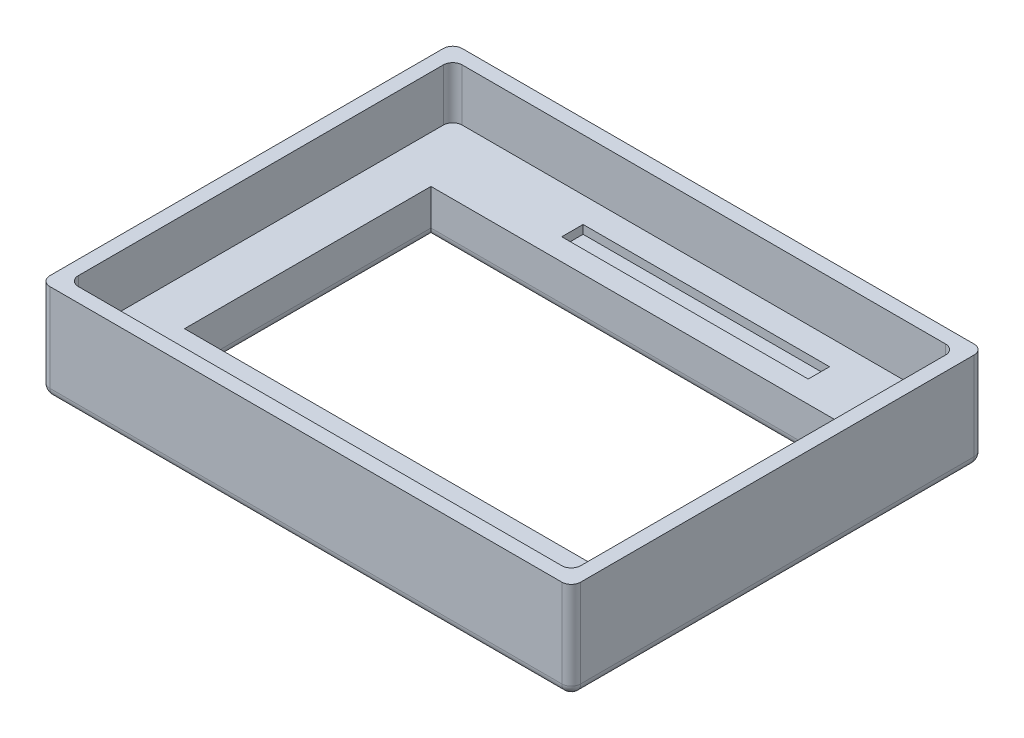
from build123d import *

# Parameters (mm, degrees)
SKETCH2_W                = 106
SKETCH2_H                = 81
BOSS_EXTRUDE1_DEPTH      = 9.6
SKETCH5_W                = 86.1
SKETCH5_H                = 52
CUT_EXTRUDE1_DEPTH       = 82.931988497
SKETCH6_W                = 52
SKETCH6_H                = 4.5
CUT_EXTRUDE2_DEPTH       = 1.8
BOSS_EXTRUDE2_DEPTH      = 11
BOSS_EXTRUDE2_DEPTH_BACK = 9.6
SKETCH7_W                = 3
SKETCH7_H                = 81
SKETCH8_W                = 112
SKETCH8_H                = 3
BOSS_EXTRUDE3_DEPTH      = 20.6
FILLET1_R                = 2
FILLET2_R                = 2


with BuildPart() as part:
    # Sketch2 → Boss-Extrude1 (new body)
    with BuildSketch(Plane(origin=(0, 0, 0), x_dir=(1, 0, 0), z_dir=(0, 1, 0))):
        with Locations((5.781721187, -15.761887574)):
            Rectangle(SKETCH2_W, SKETCH2_H)
    extrude(amount=BOSS_EXTRUDE1_DEPTH)

    # Sketch5 → Cut-Extrude1 (cut, through all)
    with BuildSketch(Plane(origin=(0, 9.6, 0), x_dir=(1, 0, 0), z_dir=(0, 1, 0))):
        with Locations((5.731721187, -15.761887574)):
            Rectangle(SKETCH5_W, SKETCH5_H)
    extrude(amount=-CUT_EXTRUDE1_DEPTH, mode=Mode.SUBTRACT)

    # Sketch6 → Cut-Extrude2 (cut)
    with BuildSketch(Plane(origin=(0, 9.6, 0), x_dir=(1, 0, 0), z_dir=(0, 1, 0))):
        with Locations((11.681721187, 17.088112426)):
            Rectangle(SKETCH6_W, SKETCH6_H)
    extrude(amount=-CUT_EXTRUDE2_DEPTH, mode=Mode.SUBTRACT)

    # Sketch7 → Boss-Extrude2 (add, two sides: drawn at the far end of the back side and taken through both)
    with BuildSketch(Plane(origin=(0, 9.6, 0), x_dir=(1, 0, 0), z_dir=(0, 1, 0)).offset(-BOSS_EXTRUDE2_DEPTH_BACK)):
        with Locations((-48.718278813, -15.761887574)):
            Rectangle(SKETCH7_W, SKETCH7_H)
        with Locations((60.281721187, -15.761887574)):
            Rectangle(SKETCH7_W, SKETCH7_H)
    extrude(amount=BOSS_EXTRUDE2_DEPTH + BOSS_EXTRUDE2_DEPTH_BACK)

    # Sketch8 → Boss-Extrude3 (add)
    with BuildSketch(Plane(origin=(0, 0, 0), x_dir=(-1, 0, 0), z_dir=(0, -1, 0))):
        with Locations((-5.781721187, 26.238112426)):
            Rectangle(SKETCH8_W, SKETCH8_H)
        with Locations((-5.781721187, -57.761887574)):
            Rectangle(SKETCH8_W, SKETCH8_H)
    extrude(amount=-BOSS_EXTRUDE3_DEPTH)

    # Fillet1
    fillet1_edges = [part.edges().sort_by_distance(p)[0] for p in [
        (-37.318278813, 0, 15.761887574),
        (5.731721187, 0, -10.238112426),
        (48.781721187, 0, 15.761887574),
        (5.731721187, 0, 41.761887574),
        (-50.218278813, 0, 15.761887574),
        (61.781721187, 0, 15.761887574),
        (61.781721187, 10.3, -27.738112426),
        (-50.218278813, 10.3, -27.738112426),
        (5.781721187, 0, -27.738112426),
        (61.781721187, 10.3, 59.261887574),
        (-50.218278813, 10.3, 59.261887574),
        (5.781721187, 0, 59.261887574),
    ]]
    fillet(fillet1_edges, radius=FILLET1_R)

    # Fillet2
    fillet2_edges = [part.edges().sort_by_distance(p)[0] for p in [
        (-47.218278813, 15.1, -24.738112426),
        (58.781721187, 15.1, -24.738112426),
        (58.781721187, 15.1, 56.261887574),
        (-47.218278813, 15.1, 56.261887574),
    ]]
    fillet(fillet2_edges, radius=FILLET2_R)


solid = part.part
